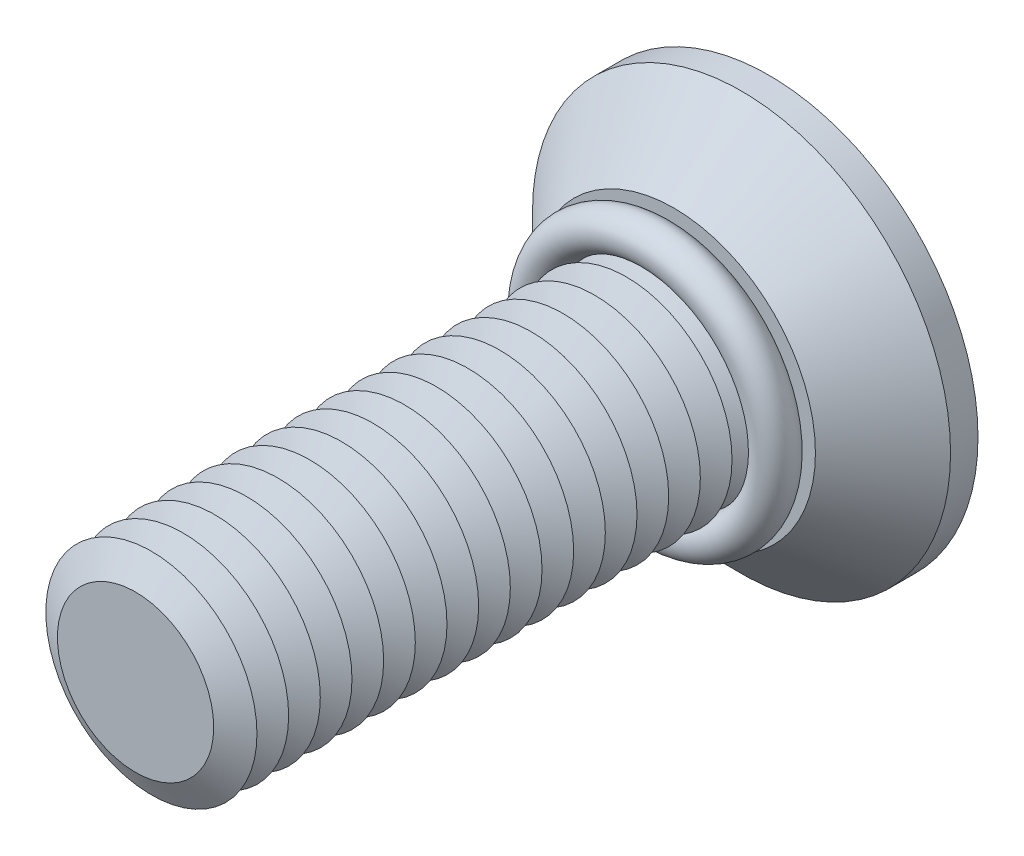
ISO-10303-21;
HEADER;
FILE_DESCRIPTION(('STEP AP214'),'2;1');
FILE_NAME('part.step','',(''),(''),'','','');
FILE_SCHEMA(('AUTOMOTIVE_DESIGN { 1 0 10303 214 1 1 1 1 }'));
ENDSEC;
DATA;
#1=APPLICATION_CONTEXT('core data for automotive mechanical design processes');
#2=APPLICATION_PROTOCOL_DEFINITION('international standard','automotive_design',2000,#1);
#3=PRODUCT_CONTEXT('',#1,'mechanical');
#4=PRODUCT('Part','Part','',(#3));
#5=PRODUCT_RELATED_PRODUCT_CATEGORY('part','',(#4));
#6=PRODUCT_DEFINITION_FORMATION('','',#4);
#7=PRODUCT_DEFINITION_CONTEXT('part definition',#1,'design');
#8=PRODUCT_DEFINITION('design','',#6,#7);
#9=PRODUCT_DEFINITION_SHAPE('','',#8);
#10=(LENGTH_UNIT() NAMED_UNIT(*) SI_UNIT(.MILLI.,.METRE.));
#11=(NAMED_UNIT(*) PLANE_ANGLE_UNIT() SI_UNIT($,.RADIAN.));
#12=(NAMED_UNIT(*) SI_UNIT($,.STERADIAN.) SOLID_ANGLE_UNIT());
#13=UNCERTAINTY_MEASURE_WITH_UNIT(LENGTH_MEASURE(1.E-05),#10,'distance_accuracy_value','');
#14=(GEOMETRIC_REPRESENTATION_CONTEXT(3) GLOBAL_UNCERTAINTY_ASSIGNED_CONTEXT((#13)) GLOBAL_UNIT_ASSIGNED_CONTEXT((#10,
#11,#12)) REPRESENTATION_CONTEXT('',''));
#15=CARTESIAN_POINT('',(0.,0.,0.));
#16=DIRECTION('',(0.,0.,1.));
#17=DIRECTION('',(1.,0.,0.));
#18=AXIS2_PLACEMENT_3D('',#15,#16,#17);
#19=CARTESIAN_POINT('',(0.,0.,5.4));
#20=DIRECTION('',(0.,0.,1.));
#21=DIRECTION('',(1.,0.,0.));
#22=AXIS2_PLACEMENT_3D('',#19,#20,#21);
#23=TOROIDAL_SURFACE('',#22,5.7,0.9);
#24=CARTESIAN_POINT('',(0.,5.7,5.4));
#25=DIRECTION('',(1.,0.,0.));
#26=DIRECTION('',(0.,0.,-1.));
#27=AXIS2_PLACEMENT_3D('',#24,#25,#26);
#28=CIRCLE('',#27,0.9);
#29=CARTESIAN_POINT('',(0.,6.6,5.4));
#30=VERTEX_POINT('',#29);
#31=EDGE_CURVE('P0_E10',#30,#30,#28,.T.);
#32=CARTESIAN_POINT('',(0.,0.,5.4));
#33=DIRECTION('',(0.,0.,1.));
#34=DIRECTION('',(1.,0.,0.));
#35=AXIS2_PLACEMENT_3D('',#32,#33,#34);
#36=CIRCLE('',#35,6.6);
#37=EDGE_CURVE('',#30,#30,#36,.T.);
#38=ORIENTED_EDGE('',*,*,#31,.F.);
#39=ORIENTED_EDGE('',*,*,#31,.T.);
#40=ORIENTED_EDGE('',*,*,#37,.T.);
#41=ORIENTED_EDGE('',*,*,#37,.F.);
#42=EDGE_LOOP('',(#38,#40,#39,#41));
#43=FACE_BOUND('',#42,.T.);
#44=ADVANCED_FACE('P0_F14',(#43),#23,.T.);
#45=CLOSED_SHELL('',(#44));
#46=MANIFOLD_SOLID_BREP('P0_B1',#45);
#47=CARTESIAN_POINT('',(0.,0.,22.5));
#48=DIRECTION('',(0.,0.,-1.));
#49=DIRECTION('',(-1.,0.,0.));
#50=AXIS2_PLACEMENT_3D('',#47,#48,#49);
#51=CONICAL_SURFACE('',#50,3.70096189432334,1.0471975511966);
#52=CARTESIAN_POINT('',(0.,0.,21.75));
#53=DIRECTION('',(0.,0.,1.));
#54=DIRECTION('',(1.,0.,0.));
#55=AXIS2_PLACEMENT_3D('',#52,#53,#54);
#56=CIRCLE('',#55,5.);
#57=CARTESIAN_POINT('',(5.,0.,21.75));
#58=VERTEX_POINT('',#57);
#59=EDGE_CURVE('P1_E324',#58,#58,#56,.T.);
#60=ORIENTED_EDGE('',*,*,#59,.T.);
#61=EDGE_LOOP('',(#60));
#62=FACE_BOUND('',#61,.T.);
#63=CARTESIAN_POINT('',(0.,0.,22.5));
#64=DIRECTION('',(0.,0.,1.));
#65=DIRECTION('',(1.,0.,0.));
#66=AXIS2_PLACEMENT_3D('',#63,#64,#65);
#67=CIRCLE('',#66,3.70096189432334);
#68=CARTESIAN_POINT('',(3.70096189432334,0.,22.5));
#69=VERTEX_POINT('',#68);
#70=EDGE_CURVE('P1_E321',#69,#69,#67,.T.);
#71=ORIENTED_EDGE('',*,*,#70,.F.);
#72=EDGE_LOOP('',(#71));
#73=FACE_BOUND('',#72,.T.);
#74=ADVANCED_FACE('P1_F15',(#62,#73),#51,.T.);
#75=CARTESIAN_POINT('',(0.,0.,23.25));
#76=DIRECTION('',(0.,0.,1.));
#77=DIRECTION('',(1.,0.,0.));
#78=AXIS2_PLACEMENT_3D('',#75,#76,#77);
#79=CONICAL_SURFACE('',#78,5.,1.0471975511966);
#80=ORIENTED_EDGE('',*,*,#70,.T.);
#81=EDGE_LOOP('',(#80));
#82=FACE_BOUND('',#81,.T.);
#83=CARTESIAN_POINT('',(0.,0.,23.25));
#84=DIRECTION('',(0.,0.,1.));
#85=DIRECTION('',(1.,0.,0.));
#86=AXIS2_PLACEMENT_3D('',#83,#84,#85);
#87=CIRCLE('',#86,5.);
#88=CARTESIAN_POINT('',(5.,0.,23.25));
#89=VERTEX_POINT('',#88);
#90=EDGE_CURVE('P1_E318',#89,#89,#87,.T.);
#91=ORIENTED_EDGE('',*,*,#90,.F.);
#92=EDGE_LOOP('',(#91));
#93=FACE_BOUND('',#92,.T.);
#94=ADVANCED_FACE('P1_F245',(#82,#93),#79,.T.);
#95=CARTESIAN_POINT('',(0.,0.,30.));
#96=DIRECTION('',(0.,0.,1.));
#97=DIRECTION('',(1.,0.,0.));
#98=AXIS2_PLACEMENT_3D('',#95,#96,#97);
#99=PLANE('',#98);
#100=CARTESIAN_POINT('',(0.,0.,30.));
#101=DIRECTION('',(0.,0.,1.));
#102=DIRECTION('',(1.,0.,0.));
#103=AXIS2_PLACEMENT_3D('',#100,#101,#102);
#104=CIRCLE('',#103,3.70096189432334);
#105=CARTESIAN_POINT('',(3.70096189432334,0.,30.));
#106=VERTEX_POINT('',#105);
#107=EDGE_CURVE('P1_E131',#106,#106,#104,.T.);
#108=ORIENTED_EDGE('',*,*,#107,.T.);
#109=EDGE_LOOP('',(#108));
#110=FACE_BOUND('',#109,.T.);
#111=ADVANCED_FACE('P1_F251',(#110),#99,.T.);
#112=CARTESIAN_POINT('',(0.,0.,30.));
#113=DIRECTION('',(0.,0.,-1.));
#114=DIRECTION('',(-1.,0.,0.));
#115=AXIS2_PLACEMENT_3D('',#112,#113,#114);
#116=CONICAL_SURFACE('',#115,3.70096189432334,1.0471975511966);
#117=CARTESIAN_POINT('',(0.,0.,29.25));
#118=DIRECTION('',(0.,0.,1.));
#119=DIRECTION('',(1.,0.,0.));
#120=AXIS2_PLACEMENT_3D('',#117,#118,#119);
#121=CIRCLE('',#120,5.);
#122=CARTESIAN_POINT('',(5.,0.,29.25));
#123=VERTEX_POINT('',#122);
#124=EDGE_CURVE('P1_E133',#123,#123,#121,.T.);
#125=ORIENTED_EDGE('',*,*,#124,.T.);
#126=EDGE_LOOP('',(#125));
#127=FACE_BOUND('',#126,.T.);
#128=ORIENTED_EDGE('',*,*,#107,.F.);
#129=EDGE_LOOP('',(#128));
#130=FACE_BOUND('',#129,.T.);
#131=ADVANCED_FACE('P1_F196',(#127,#130),#116,.T.);
#132=CARTESIAN_POINT('',(0.,0.,29.25));
#133=DIRECTION('',(0.,0.,1.));
#134=DIRECTION('',(1.,0.,0.));
#135=AXIS2_PLACEMENT_3D('',#132,#133,#134);
#136=CONICAL_SURFACE('',#135,5.,1.0471975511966);
#137=CARTESIAN_POINT('',(0.,0.,28.5));
#138=DIRECTION('',(0.,0.,1.));
#139=DIRECTION('',(1.,0.,0.));
#140=AXIS2_PLACEMENT_3D('',#137,#138,#139);
#141=CIRCLE('',#140,3.70096189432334);
#142=CARTESIAN_POINT('',(3.70096189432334,0.,28.5));
#143=VERTEX_POINT('',#142);
#144=EDGE_CURVE('P1_E297',#143,#143,#141,.T.);
#145=ORIENTED_EDGE('',*,*,#144,.T.);
#146=EDGE_LOOP('',(#145));
#147=FACE_BOUND('',#146,.T.);
#148=ORIENTED_EDGE('',*,*,#124,.F.);
#149=EDGE_LOOP('',(#148));
#150=FACE_BOUND('',#149,.T.);
#151=ADVANCED_FACE('P1_F284',(#147,#150),#136,.T.);
#152=CARTESIAN_POINT('',(0.,0.,28.5));
#153=DIRECTION('',(0.,0.,-1.));
#154=DIRECTION('',(-1.,0.,0.));
#155=AXIS2_PLACEMENT_3D('',#152,#153,#154);
#156=CONICAL_SURFACE('',#155,3.70096189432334,1.0471975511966);
#157=CARTESIAN_POINT('',(0.,0.,27.75));
#158=DIRECTION('',(0.,0.,1.));
#159=DIRECTION('',(1.,0.,0.));
#160=AXIS2_PLACEMENT_3D('',#157,#158,#159);
#161=CIRCLE('',#160,5.);
#162=CARTESIAN_POINT('',(5.,0.,27.75));
#163=VERTEX_POINT('',#162);
#164=EDGE_CURVE('P1_E294',#163,#163,#161,.T.);
#165=ORIENTED_EDGE('',*,*,#164,.T.);
#166=EDGE_LOOP('',(#165));
#167=FACE_BOUND('',#166,.T.);
#168=ORIENTED_EDGE('',*,*,#144,.F.);
#169=EDGE_LOOP('',(#168));
#170=FACE_BOUND('',#169,.T.);
#171=ADVANCED_FACE('P1_F279',(#167,#170),#156,.T.);
#172=CARTESIAN_POINT('',(0.,0.,27.75));
#173=DIRECTION('',(0.,0.,1.));
#174=DIRECTION('',(1.,0.,0.));
#175=AXIS2_PLACEMENT_3D('',#172,#173,#174);
#176=CONICAL_SURFACE('',#175,5.,1.0471975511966);
#177=CARTESIAN_POINT('',(0.,0.,27.));
#178=DIRECTION('',(0.,0.,1.));
#179=DIRECTION('',(1.,0.,0.));
#180=AXIS2_PLACEMENT_3D('',#177,#178,#179);
#181=CIRCLE('',#180,3.70096189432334);
#182=CARTESIAN_POINT('',(3.70096189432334,0.,27.));
#183=VERTEX_POINT('',#182);
#184=EDGE_CURVE('P1_E301',#183,#183,#181,.T.);
#185=ORIENTED_EDGE('',*,*,#184,.T.);
#186=EDGE_LOOP('',(#185));
#187=FACE_BOUND('',#186,.T.);
#188=ORIENTED_EDGE('',*,*,#164,.F.);
#189=EDGE_LOOP('',(#188));
#190=FACE_BOUND('',#189,.T.);
#191=ADVANCED_FACE('P1_F276',(#187,#190),#176,.T.);
#192=CARTESIAN_POINT('',(0.,0.,27.));
#193=DIRECTION('',(0.,0.,-1.));
#194=DIRECTION('',(-1.,0.,0.));
#195=AXIS2_PLACEMENT_3D('',#192,#193,#194);
#196=CONICAL_SURFACE('',#195,3.70096189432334,1.0471975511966);
#197=CARTESIAN_POINT('',(0.,0.,26.25));
#198=DIRECTION('',(0.,0.,1.));
#199=DIRECTION('',(1.,0.,0.));
#200=AXIS2_PLACEMENT_3D('',#197,#198,#199);
#201=CIRCLE('',#200,5.);
#202=CARTESIAN_POINT('',(5.,0.,26.25));
#203=VERTEX_POINT('',#202);
#204=EDGE_CURVE('P1_E306',#203,#203,#201,.T.);
#205=ORIENTED_EDGE('',*,*,#204,.T.);
#206=EDGE_LOOP('',(#205));
#207=FACE_BOUND('',#206,.T.);
#208=ORIENTED_EDGE('',*,*,#184,.F.);
#209=EDGE_LOOP('',(#208));
#210=FACE_BOUND('',#209,.T.);
#211=ADVANCED_FACE('P1_F271',(#207,#210),#196,.T.);
#212=CARTESIAN_POINT('',(0.,0.,26.25));
#213=DIRECTION('',(0.,0.,1.));
#214=DIRECTION('',(1.,0.,0.));
#215=AXIS2_PLACEMENT_3D('',#212,#213,#214);
#216=CONICAL_SURFACE('',#215,5.,1.0471975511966);
#217=CARTESIAN_POINT('',(0.,0.,25.5));
#218=DIRECTION('',(0.,0.,1.));
#219=DIRECTION('',(1.,0.,0.));
#220=AXIS2_PLACEMENT_3D('',#217,#218,#219);
#221=CIRCLE('',#220,3.70096189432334);
#222=CARTESIAN_POINT('',(3.70096189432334,0.,25.5));
#223=VERTEX_POINT('',#222);
#224=EDGE_CURVE('P1_E309',#223,#223,#221,.T.);
#225=ORIENTED_EDGE('',*,*,#224,.T.);
#226=EDGE_LOOP('',(#225));
#227=FACE_BOUND('',#226,.T.);
#228=ORIENTED_EDGE('',*,*,#204,.F.);
#229=EDGE_LOOP('',(#228));
#230=FACE_BOUND('',#229,.T.);
#231=ADVANCED_FACE('P1_F268',(#227,#230),#216,.T.);
#232=CARTESIAN_POINT('',(0.,0.,25.5));
#233=DIRECTION('',(0.,0.,-1.));
#234=DIRECTION('',(-1.,0.,0.));
#235=AXIS2_PLACEMENT_3D('',#232,#233,#234);
#236=CONICAL_SURFACE('',#235,3.70096189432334,1.0471975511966);
#237=CARTESIAN_POINT('',(0.,0.,24.75));
#238=DIRECTION('',(0.,0.,1.));
#239=DIRECTION('',(1.,0.,0.));
#240=AXIS2_PLACEMENT_3D('',#237,#238,#239);
#241=CIRCLE('',#240,5.);
#242=CARTESIAN_POINT('',(5.,0.,24.75));
#243=VERTEX_POINT('',#242);
#244=EDGE_CURVE('P1_E312',#243,#243,#241,.T.);
#245=ORIENTED_EDGE('',*,*,#244,.T.);
#246=EDGE_LOOP('',(#245));
#247=FACE_BOUND('',#246,.T.);
#248=ORIENTED_EDGE('',*,*,#224,.F.);
#249=EDGE_LOOP('',(#248));
#250=FACE_BOUND('',#249,.T.);
#251=ADVANCED_FACE('P1_F262',(#247,#250),#236,.T.);
#252=CARTESIAN_POINT('',(0.,0.,24.75));
#253=DIRECTION('',(0.,0.,1.));
#254=DIRECTION('',(1.,0.,0.));
#255=AXIS2_PLACEMENT_3D('',#252,#253,#254);
#256=CONICAL_SURFACE('',#255,5.,1.0471975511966);
#257=CARTESIAN_POINT('',(0.,0.,24.));
#258=DIRECTION('',(0.,0.,1.));
#259=DIRECTION('',(1.,0.,0.));
#260=AXIS2_PLACEMENT_3D('',#257,#258,#259);
#261=CIRCLE('',#260,3.70096189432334);
#262=CARTESIAN_POINT('',(3.70096189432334,0.,24.));
#263=VERTEX_POINT('',#262);
#264=EDGE_CURVE('P1_E315',#263,#263,#261,.T.);
#265=ORIENTED_EDGE('',*,*,#264,.T.);
#266=EDGE_LOOP('',(#265));
#267=FACE_BOUND('',#266,.T.);
#268=ORIENTED_EDGE('',*,*,#244,.F.);
#269=EDGE_LOOP('',(#268));
#270=FACE_BOUND('',#269,.T.);
#271=ADVANCED_FACE('P1_F258',(#267,#270),#256,.T.);
#272=CARTESIAN_POINT('',(0.,0.,24.));
#273=DIRECTION('',(0.,0.,-1.));
#274=DIRECTION('',(-1.,0.,0.));
#275=AXIS2_PLACEMENT_3D('',#272,#273,#274);
#276=CONICAL_SURFACE('',#275,3.70096189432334,1.0471975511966);
#277=ORIENTED_EDGE('',*,*,#90,.T.);
#278=EDGE_LOOP('',(#277));
#279=FACE_BOUND('',#278,.T.);
#280=ORIENTED_EDGE('',*,*,#264,.F.);
#281=EDGE_LOOP('',(#280));
#282=FACE_BOUND('',#281,.T.);
#283=ADVANCED_FACE('P1_F261',(#279,#282),#276,.T.);
#284=CARTESIAN_POINT('',(0.,0.,21.));
#285=DIRECTION('',(0.,0.,-1.));
#286=DIRECTION('',(-1.,0.,0.));
#287=AXIS2_PLACEMENT_3D('',#284,#285,#286);
#288=CONICAL_SURFACE('',#287,3.70096189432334,1.0471975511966);
#289=CARTESIAN_POINT('',(0.,0.,20.25));
#290=DIRECTION('',(0.,0.,1.));
#291=DIRECTION('',(1.,0.,0.));
#292=AXIS2_PLACEMENT_3D('',#289,#290,#291);
#293=CIRCLE('',#292,5.);
#294=CARTESIAN_POINT('',(5.,0.,20.25));
#295=VERTEX_POINT('',#294);
#296=EDGE_CURVE('P1_E329',#295,#295,#293,.T.);
#297=ORIENTED_EDGE('',*,*,#296,.T.);
#298=EDGE_LOOP('',(#297));
#299=FACE_BOUND('',#298,.T.);
#300=CARTESIAN_POINT('',(0.,0.,21.));
#301=DIRECTION('',(0.,0.,1.));
#302=DIRECTION('',(1.,0.,0.));
#303=AXIS2_PLACEMENT_3D('',#300,#301,#302);
#304=CIRCLE('',#303,3.70096189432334);
#305=CARTESIAN_POINT('',(3.70096189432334,0.,21.));
#306=VERTEX_POINT('',#305);
#307=EDGE_CURVE('P1_E326',#306,#306,#304,.T.);
#308=ORIENTED_EDGE('',*,*,#307,.F.);
#309=EDGE_LOOP('',(#308));
#310=FACE_BOUND('',#309,.T.);
#311=ADVANCED_FACE('P1_F266',(#299,#310),#288,.T.);
#312=CARTESIAN_POINT('',(0.,0.,21.75));
#313=DIRECTION('',(0.,0.,1.));
#314=DIRECTION('',(1.,0.,0.));
#315=AXIS2_PLACEMENT_3D('',#312,#313,#314);
#316=CONICAL_SURFACE('',#315,5.,1.0471975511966);
#317=ORIENTED_EDGE('',*,*,#307,.T.);
#318=EDGE_LOOP('',(#317));
#319=FACE_BOUND('',#318,.T.);
#320=ORIENTED_EDGE('',*,*,#59,.F.);
#321=EDGE_LOOP('',(#320));
#322=FACE_BOUND('',#321,.T.);
#323=ADVANCED_FACE('P1_F491',(#319,#322),#316,.T.);
#324=CARTESIAN_POINT('',(0.,0.,19.5));
#325=DIRECTION('',(0.,0.,-1.));
#326=DIRECTION('',(-1.,0.,0.));
#327=AXIS2_PLACEMENT_3D('',#324,#325,#326);
#328=CONICAL_SURFACE('',#327,3.70096189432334,1.0471975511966);
#329=CARTESIAN_POINT('',(0.,0.,18.75));
#330=DIRECTION('',(0.,0.,1.));
#331=DIRECTION('',(1.,0.,0.));
#332=AXIS2_PLACEMENT_3D('',#329,#330,#331);
#333=CIRCLE('',#332,5.);
#334=CARTESIAN_POINT('',(5.,0.,18.75));
#335=VERTEX_POINT('',#334);
#336=EDGE_CURVE('P1_E335',#335,#335,#333,.T.);
#337=ORIENTED_EDGE('',*,*,#336,.T.);
#338=EDGE_LOOP('',(#337));
#339=FACE_BOUND('',#338,.T.);
#340=CARTESIAN_POINT('',(0.,0.,19.5));
#341=DIRECTION('',(0.,0.,1.));
#342=DIRECTION('',(1.,0.,0.));
#343=AXIS2_PLACEMENT_3D('',#340,#341,#342);
#344=CIRCLE('',#343,3.70096189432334);
#345=CARTESIAN_POINT('',(3.70096189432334,0.,19.5));
#346=VERTEX_POINT('',#345);
#347=EDGE_CURVE('P1_E332',#346,#346,#344,.T.);
#348=ORIENTED_EDGE('',*,*,#347,.F.);
#349=EDGE_LOOP('',(#348));
#350=FACE_BOUND('',#349,.T.);
#351=ADVANCED_FACE('P1_F500',(#339,#350),#328,.T.);
#352=CARTESIAN_POINT('',(0.,0.,20.25));
#353=DIRECTION('',(0.,0.,1.));
#354=DIRECTION('',(1.,0.,0.));
#355=AXIS2_PLACEMENT_3D('',#352,#353,#354);
#356=CONICAL_SURFACE('',#355,5.,1.0471975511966);
#357=ORIENTED_EDGE('',*,*,#347,.T.);
#358=EDGE_LOOP('',(#357));
#359=FACE_BOUND('',#358,.T.);
#360=ORIENTED_EDGE('',*,*,#296,.F.);
#361=EDGE_LOOP('',(#360));
#362=FACE_BOUND('',#361,.T.);
#363=ADVANCED_FACE('P1_F510',(#359,#362),#356,.T.);
#364=CARTESIAN_POINT('',(0.,0.,18.));
#365=DIRECTION('',(0.,0.,-1.));
#366=DIRECTION('',(-1.,0.,0.));
#367=AXIS2_PLACEMENT_3D('',#364,#365,#366);
#368=CONICAL_SURFACE('',#367,3.70096189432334,1.0471975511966);
#369=CARTESIAN_POINT('',(0.,0.,17.25));
#370=DIRECTION('',(0.,0.,1.));
#371=DIRECTION('',(1.,0.,0.));
#372=AXIS2_PLACEMENT_3D('',#369,#370,#371);
#373=CIRCLE('',#372,5.);
#374=CARTESIAN_POINT('',(5.,0.,17.25));
#375=VERTEX_POINT('',#374);
#376=EDGE_CURVE('P1_E341',#375,#375,#373,.T.);
#377=ORIENTED_EDGE('',*,*,#376,.T.);
#378=EDGE_LOOP('',(#377));
#379=FACE_BOUND('',#378,.T.);
#380=CARTESIAN_POINT('',(0.,0.,18.));
#381=DIRECTION('',(0.,0.,1.));
#382=DIRECTION('',(1.,0.,0.));
#383=AXIS2_PLACEMENT_3D('',#380,#381,#382);
#384=CIRCLE('',#383,3.70096189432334);
#385=CARTESIAN_POINT('',(3.70096189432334,0.,18.));
#386=VERTEX_POINT('',#385);
#387=EDGE_CURVE('P1_E338',#386,#386,#384,.T.);
#388=ORIENTED_EDGE('',*,*,#387,.F.);
#389=EDGE_LOOP('',(#388));
#390=FACE_BOUND('',#389,.T.);
#391=ADVANCED_FACE('P1_F520',(#379,#390),#368,.T.);
#392=CARTESIAN_POINT('',(0.,0.,18.75));
#393=DIRECTION('',(0.,0.,1.));
#394=DIRECTION('',(1.,0.,0.));
#395=AXIS2_PLACEMENT_3D('',#392,#393,#394);
#396=CONICAL_SURFACE('',#395,5.,1.0471975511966);
#397=ORIENTED_EDGE('',*,*,#387,.T.);
#398=EDGE_LOOP('',(#397));
#399=FACE_BOUND('',#398,.T.);
#400=ORIENTED_EDGE('',*,*,#336,.F.);
#401=EDGE_LOOP('',(#400));
#402=FACE_BOUND('',#401,.T.);
#403=ADVANCED_FACE('P1_F530',(#399,#402),#396,.T.);
#404=CARTESIAN_POINT('',(0.,0.,16.5));
#405=DIRECTION('',(0.,0.,-1.));
#406=DIRECTION('',(-1.,0.,0.));
#407=AXIS2_PLACEMENT_3D('',#404,#405,#406);
#408=CONICAL_SURFACE('',#407,3.70096189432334,1.0471975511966);
#409=CARTESIAN_POINT('',(0.,0.,15.75));
#410=DIRECTION('',(0.,0.,1.));
#411=DIRECTION('',(1.,0.,0.));
#412=AXIS2_PLACEMENT_3D('',#409,#410,#411);
#413=CIRCLE('',#412,5.);
#414=CARTESIAN_POINT('',(5.,0.,15.75));
#415=VERTEX_POINT('',#414);
#416=EDGE_CURVE('P1_E347',#415,#415,#413,.T.);
#417=ORIENTED_EDGE('',*,*,#416,.T.);
#418=EDGE_LOOP('',(#417));
#419=FACE_BOUND('',#418,.T.);
#420=CARTESIAN_POINT('',(0.,0.,16.5));
#421=DIRECTION('',(0.,0.,1.));
#422=DIRECTION('',(1.,0.,0.));
#423=AXIS2_PLACEMENT_3D('',#420,#421,#422);
#424=CIRCLE('',#423,3.70096189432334);
#425=CARTESIAN_POINT('',(3.70096189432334,0.,16.5));
#426=VERTEX_POINT('',#425);
#427=EDGE_CURVE('P1_E344',#426,#426,#424,.T.);
#428=ORIENTED_EDGE('',*,*,#427,.F.);
#429=EDGE_LOOP('',(#428));
#430=FACE_BOUND('',#429,.T.);
#431=ADVANCED_FACE('P1_F540',(#419,#430),#408,.T.);
#432=CARTESIAN_POINT('',(0.,0.,17.25));
#433=DIRECTION('',(0.,0.,1.));
#434=DIRECTION('',(1.,0.,0.));
#435=AXIS2_PLACEMENT_3D('',#432,#433,#434);
#436=CONICAL_SURFACE('',#435,5.,1.0471975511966);
#437=ORIENTED_EDGE('',*,*,#427,.T.);
#438=EDGE_LOOP('',(#437));
#439=FACE_BOUND('',#438,.T.);
#440=ORIENTED_EDGE('',*,*,#376,.F.);
#441=EDGE_LOOP('',(#440));
#442=FACE_BOUND('',#441,.T.);
#443=ADVANCED_FACE('P1_F550',(#439,#442),#436,.T.);
#444=CARTESIAN_POINT('',(0.,0.,15.));
#445=DIRECTION('',(0.,0.,-1.));
#446=DIRECTION('',(-1.,0.,0.));
#447=AXIS2_PLACEMENT_3D('',#444,#445,#446);
#448=CONICAL_SURFACE('',#447,3.70096189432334,1.0471975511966);
#449=CARTESIAN_POINT('',(0.,0.,14.25));
#450=DIRECTION('',(0.,0.,1.));
#451=DIRECTION('',(1.,0.,0.));
#452=AXIS2_PLACEMENT_3D('',#449,#450,#451);
#453=CIRCLE('',#452,5.);
#454=CARTESIAN_POINT('',(5.,0.,14.25));
#455=VERTEX_POINT('',#454);
#456=EDGE_CURVE('P1_E353',#455,#455,#453,.T.);
#457=ORIENTED_EDGE('',*,*,#456,.T.);
#458=EDGE_LOOP('',(#457));
#459=FACE_BOUND('',#458,.T.);
#460=CARTESIAN_POINT('',(0.,0.,15.));
#461=DIRECTION('',(0.,0.,1.));
#462=DIRECTION('',(1.,0.,0.));
#463=AXIS2_PLACEMENT_3D('',#460,#461,#462);
#464=CIRCLE('',#463,3.70096189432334);
#465=CARTESIAN_POINT('',(3.70096189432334,0.,15.));
#466=VERTEX_POINT('',#465);
#467=EDGE_CURVE('P1_E350',#466,#466,#464,.T.);
#468=ORIENTED_EDGE('',*,*,#467,.F.);
#469=EDGE_LOOP('',(#468));
#470=FACE_BOUND('',#469,.T.);
#471=ADVANCED_FACE('P1_F560',(#459,#470),#448,.T.);
#472=CARTESIAN_POINT('',(0.,0.,15.75));
#473=DIRECTION('',(0.,0.,1.));
#474=DIRECTION('',(1.,0.,0.));
#475=AXIS2_PLACEMENT_3D('',#472,#473,#474);
#476=CONICAL_SURFACE('',#475,5.,1.0471975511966);
#477=ORIENTED_EDGE('',*,*,#467,.T.);
#478=EDGE_LOOP('',(#477));
#479=FACE_BOUND('',#478,.T.);
#480=ORIENTED_EDGE('',*,*,#416,.F.);
#481=EDGE_LOOP('',(#480));
#482=FACE_BOUND('',#481,.T.);
#483=ADVANCED_FACE('P1_F570',(#479,#482),#476,.T.);
#484=CARTESIAN_POINT('',(0.,0.,13.5));
#485=DIRECTION('',(0.,0.,-1.));
#486=DIRECTION('',(-1.,0.,0.));
#487=AXIS2_PLACEMENT_3D('',#484,#485,#486);
#488=CONICAL_SURFACE('',#487,3.70096189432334,1.0471975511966);
#489=CARTESIAN_POINT('',(0.,0.,12.75));
#490=DIRECTION('',(0.,0.,1.));
#491=DIRECTION('',(1.,0.,0.));
#492=AXIS2_PLACEMENT_3D('',#489,#490,#491);
#493=CIRCLE('',#492,5.);
#494=CARTESIAN_POINT('',(5.,0.,12.75));
#495=VERTEX_POINT('',#494);
#496=EDGE_CURVE('P1_E359',#495,#495,#493,.T.);
#497=ORIENTED_EDGE('',*,*,#496,.T.);
#498=EDGE_LOOP('',(#497));
#499=FACE_BOUND('',#498,.T.);
#500=CARTESIAN_POINT('',(0.,0.,13.5));
#501=DIRECTION('',(0.,0.,1.));
#502=DIRECTION('',(1.,0.,0.));
#503=AXIS2_PLACEMENT_3D('',#500,#501,#502);
#504=CIRCLE('',#503,3.70096189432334);
#505=CARTESIAN_POINT('',(3.70096189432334,0.,13.5));
#506=VERTEX_POINT('',#505);
#507=EDGE_CURVE('P1_E356',#506,#506,#504,.T.);
#508=ORIENTED_EDGE('',*,*,#507,.F.);
#509=EDGE_LOOP('',(#508));
#510=FACE_BOUND('',#509,.T.);
#511=ADVANCED_FACE('P1_F580',(#499,#510),#488,.T.);
#512=CARTESIAN_POINT('',(0.,0.,14.25));
#513=DIRECTION('',(0.,0.,1.));
#514=DIRECTION('',(1.,0.,0.));
#515=AXIS2_PLACEMENT_3D('',#512,#513,#514);
#516=CONICAL_SURFACE('',#515,5.,1.0471975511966);
#517=ORIENTED_EDGE('',*,*,#507,.T.);
#518=EDGE_LOOP('',(#517));
#519=FACE_BOUND('',#518,.T.);
#520=ORIENTED_EDGE('',*,*,#456,.F.);
#521=EDGE_LOOP('',(#520));
#522=FACE_BOUND('',#521,.T.);
#523=ADVANCED_FACE('P1_F590',(#519,#522),#516,.T.);
#524=CARTESIAN_POINT('',(0.,0.,12.));
#525=DIRECTION('',(0.,0.,-1.));
#526=DIRECTION('',(-1.,0.,0.));
#527=AXIS2_PLACEMENT_3D('',#524,#525,#526);
#528=CONICAL_SURFACE('',#527,3.70096189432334,1.0471975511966);
#529=CARTESIAN_POINT('',(0.,0.,11.25));
#530=DIRECTION('',(0.,0.,1.));
#531=DIRECTION('',(1.,0.,0.));
#532=AXIS2_PLACEMENT_3D('',#529,#530,#531);
#533=CIRCLE('',#532,5.);
#534=CARTESIAN_POINT('',(5.,0.,11.25));
#535=VERTEX_POINT('',#534);
#536=EDGE_CURVE('P1_E365',#535,#535,#533,.T.);
#537=ORIENTED_EDGE('',*,*,#536,.T.);
#538=EDGE_LOOP('',(#537));
#539=FACE_BOUND('',#538,.T.);
#540=CARTESIAN_POINT('',(0.,0.,12.));
#541=DIRECTION('',(0.,0.,1.));
#542=DIRECTION('',(1.,0.,0.));
#543=AXIS2_PLACEMENT_3D('',#540,#541,#542);
#544=CIRCLE('',#543,3.70096189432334);
#545=CARTESIAN_POINT('',(3.70096189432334,0.,12.));
#546=VERTEX_POINT('',#545);
#547=EDGE_CURVE('P1_E362',#546,#546,#544,.T.);
#548=ORIENTED_EDGE('',*,*,#547,.F.);
#549=EDGE_LOOP('',(#548));
#550=FACE_BOUND('',#549,.T.);
#551=ADVANCED_FACE('P1_F600',(#539,#550),#528,.T.);
#552=CARTESIAN_POINT('',(0.,0.,12.75));
#553=DIRECTION('',(0.,0.,1.));
#554=DIRECTION('',(1.,0.,0.));
#555=AXIS2_PLACEMENT_3D('',#552,#553,#554);
#556=CONICAL_SURFACE('',#555,5.,1.0471975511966);
#557=ORIENTED_EDGE('',*,*,#547,.T.);
#558=EDGE_LOOP('',(#557));
#559=FACE_BOUND('',#558,.T.);
#560=ORIENTED_EDGE('',*,*,#496,.F.);
#561=EDGE_LOOP('',(#560));
#562=FACE_BOUND('',#561,.T.);
#563=ADVANCED_FACE('P1_F610',(#559,#562),#556,.T.);
#564=CARTESIAN_POINT('',(0.,0.,10.5));
#565=DIRECTION('',(0.,0.,-1.));
#566=DIRECTION('',(-1.,0.,0.));
#567=AXIS2_PLACEMENT_3D('',#564,#565,#566);
#568=CONICAL_SURFACE('',#567,3.70096189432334,1.0471975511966);
#569=CARTESIAN_POINT('',(0.,0.,9.75));
#570=DIRECTION('',(0.,0.,1.));
#571=DIRECTION('',(1.,0.,0.));
#572=AXIS2_PLACEMENT_3D('',#569,#570,#571);
#573=CIRCLE('',#572,5.);
#574=CARTESIAN_POINT('',(5.,0.,9.75));
#575=VERTEX_POINT('',#574);
#576=EDGE_CURVE('P1_E371',#575,#575,#573,.T.);
#577=ORIENTED_EDGE('',*,*,#576,.T.);
#578=EDGE_LOOP('',(#577));
#579=FACE_BOUND('',#578,.T.);
#580=CARTESIAN_POINT('',(0.,0.,10.5));
#581=DIRECTION('',(0.,0.,1.));
#582=DIRECTION('',(1.,0.,0.));
#583=AXIS2_PLACEMENT_3D('',#580,#581,#582);
#584=CIRCLE('',#583,3.70096189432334);
#585=CARTESIAN_POINT('',(3.70096189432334,0.,10.5));
#586=VERTEX_POINT('',#585);
#587=EDGE_CURVE('P1_E368',#586,#586,#584,.T.);
#588=ORIENTED_EDGE('',*,*,#587,.F.);
#589=EDGE_LOOP('',(#588));
#590=FACE_BOUND('',#589,.T.);
#591=ADVANCED_FACE('P1_F620',(#579,#590),#568,.T.);
#592=CARTESIAN_POINT('',(0.,0.,11.25));
#593=DIRECTION('',(0.,0.,1.));
#594=DIRECTION('',(1.,0.,0.));
#595=AXIS2_PLACEMENT_3D('',#592,#593,#594);
#596=CONICAL_SURFACE('',#595,5.,1.0471975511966);
#597=ORIENTED_EDGE('',*,*,#587,.T.);
#598=EDGE_LOOP('',(#597));
#599=FACE_BOUND('',#598,.T.);
#600=ORIENTED_EDGE('',*,*,#536,.F.);
#601=EDGE_LOOP('',(#600));
#602=FACE_BOUND('',#601,.T.);
#603=ADVANCED_FACE('P1_F630',(#599,#602),#596,.T.);
#604=CARTESIAN_POINT('',(0.,0.,9.));
#605=DIRECTION('',(0.,0.,-1.));
#606=DIRECTION('',(-1.,0.,0.));
#607=AXIS2_PLACEMENT_3D('',#604,#605,#606);
#608=CONICAL_SURFACE('',#607,3.70096189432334,1.0471975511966);
#609=CARTESIAN_POINT('',(0.,0.,8.25));
#610=DIRECTION('',(0.,0.,1.));
#611=DIRECTION('',(1.,0.,0.));
#612=AXIS2_PLACEMENT_3D('',#609,#610,#611);
#613=CIRCLE('',#612,5.);
#614=CARTESIAN_POINT('',(5.,0.,8.25));
#615=VERTEX_POINT('',#614);
#616=EDGE_CURVE('P1_E377',#615,#615,#613,.T.);
#617=ORIENTED_EDGE('',*,*,#616,.T.);
#618=EDGE_LOOP('',(#617));
#619=FACE_BOUND('',#618,.T.);
#620=CARTESIAN_POINT('',(0.,0.,9.));
#621=DIRECTION('',(0.,0.,1.));
#622=DIRECTION('',(1.,0.,0.));
#623=AXIS2_PLACEMENT_3D('',#620,#621,#622);
#624=CIRCLE('',#623,3.70096189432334);
#625=CARTESIAN_POINT('',(3.70096189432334,0.,9.));
#626=VERTEX_POINT('',#625);
#627=EDGE_CURVE('P1_E374',#626,#626,#624,.T.);
#628=ORIENTED_EDGE('',*,*,#627,.F.);
#629=EDGE_LOOP('',(#628));
#630=FACE_BOUND('',#629,.T.);
#631=ADVANCED_FACE('P1_F640',(#619,#630),#608,.T.);
#632=CARTESIAN_POINT('',(0.,0.,9.75));
#633=DIRECTION('',(0.,0.,1.));
#634=DIRECTION('',(1.,0.,0.));
#635=AXIS2_PLACEMENT_3D('',#632,#633,#634);
#636=CONICAL_SURFACE('',#635,5.,1.0471975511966);
#637=ORIENTED_EDGE('',*,*,#627,.T.);
#638=EDGE_LOOP('',(#637));
#639=FACE_BOUND('',#638,.T.);
#640=ORIENTED_EDGE('',*,*,#576,.F.);
#641=EDGE_LOOP('',(#640));
#642=FACE_BOUND('',#641,.T.);
#643=ADVANCED_FACE('P1_F650',(#639,#642),#636,.T.);
#644=CARTESIAN_POINT('',(0.,0.,7.5));
#645=DIRECTION('',(0.,0.,-1.));
#646=DIRECTION('',(-1.,0.,0.));
#647=AXIS2_PLACEMENT_3D('',#644,#645,#646);
#648=CONICAL_SURFACE('',#647,3.70096189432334,1.0471975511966);
#649=CARTESIAN_POINT('',(0.,0.,6.75));
#650=DIRECTION('',(0.,0.,1.));
#651=DIRECTION('',(1.,0.,0.));
#652=AXIS2_PLACEMENT_3D('',#649,#650,#651);
#653=CIRCLE('',#652,5.);
#654=CARTESIAN_POINT('',(5.,0.,6.75));
#655=VERTEX_POINT('',#654);
#656=EDGE_CURVE('P1_E383',#655,#655,#653,.T.);
#657=ORIENTED_EDGE('',*,*,#656,.T.);
#658=EDGE_LOOP('',(#657));
#659=FACE_BOUND('',#658,.T.);
#660=CARTESIAN_POINT('',(0.,0.,7.5));
#661=DIRECTION('',(0.,0.,1.));
#662=DIRECTION('',(1.,0.,0.));
#663=AXIS2_PLACEMENT_3D('',#660,#661,#662);
#664=CIRCLE('',#663,3.70096189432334);
#665=CARTESIAN_POINT('',(3.70096189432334,0.,7.5));
#666=VERTEX_POINT('',#665);
#667=EDGE_CURVE('P1_E380',#666,#666,#664,.T.);
#668=ORIENTED_EDGE('',*,*,#667,.F.);
#669=EDGE_LOOP('',(#668));
#670=FACE_BOUND('',#669,.T.);
#671=ADVANCED_FACE('P1_F660',(#659,#670),#648,.T.);
#672=CARTESIAN_POINT('',(0.,0.,8.25));
#673=DIRECTION('',(0.,0.,1.));
#674=DIRECTION('',(1.,0.,0.));
#675=AXIS2_PLACEMENT_3D('',#672,#673,#674);
#676=CONICAL_SURFACE('',#675,5.,1.0471975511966);
#677=ORIENTED_EDGE('',*,*,#667,.T.);
#678=EDGE_LOOP('',(#677));
#679=FACE_BOUND('',#678,.T.);
#680=ORIENTED_EDGE('',*,*,#616,.F.);
#681=EDGE_LOOP('',(#680));
#682=FACE_BOUND('',#681,.T.);
#683=ADVANCED_FACE('P1_F396',(#679,#682),#676,.T.);
#684=CARTESIAN_POINT('',(0.,0.,6.));
#685=DIRECTION('',(0.,0.,-1.));
#686=DIRECTION('',(-1.,0.,0.));
#687=AXIS2_PLACEMENT_3D('',#684,#685,#686);
#688=CONICAL_SURFACE('',#687,3.70096189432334,1.0471975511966);
#689=CARTESIAN_POINT('',(0.,0.,6.));
#690=DIRECTION('',(0.,0.,1.));
#691=DIRECTION('',(1.,0.,0.));
#692=AXIS2_PLACEMENT_3D('',#689,#690,#691);
#693=CIRCLE('',#692,3.70096189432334);
#694=CARTESIAN_POINT('',(3.70096189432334,0.,6.));
#695=VERTEX_POINT('',#694);
#696=EDGE_CURVE('P1_E386',#695,#695,#693,.T.);
#697=ORIENTED_EDGE('',*,*,#696,.F.);
#698=EDGE_LOOP('',(#697));
#699=FACE_BOUND('',#698,.T.);
#700=CARTESIAN_POINT('',(0.,0.,5.36547005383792));
#701=DIRECTION('',(0.,0.,-1.));
#702=DIRECTION('',(-1.,0.,0.));
#703=AXIS2_PLACEMENT_3D('',#700,#701,#702);
#704=CIRCLE('',#703,4.8);
#705=CARTESIAN_POINT('',(-4.8,0.,5.36547005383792));
#706=VERTEX_POINT('',#705);
#707=EDGE_CURVE('P1_E19',#706,#706,#704,.F.);
#708=ORIENTED_EDGE('',*,*,#707,.T.);
#709=EDGE_LOOP('',(#708));
#710=FACE_BOUND('',#709,.T.);
#711=ADVANCED_FACE('P1_F393',(#699,#710),#688,.T.);
#712=CARTESIAN_POINT('',(0.,0.,6.75));
#713=DIRECTION('',(0.,0.,1.));
#714=DIRECTION('',(1.,0.,0.));
#715=AXIS2_PLACEMENT_3D('',#712,#713,#714);
#716=CONICAL_SURFACE('',#715,5.,1.0471975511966);
#717=ORIENTED_EDGE('',*,*,#696,.T.);
#718=EDGE_LOOP('',(#717));
#719=FACE_BOUND('',#718,.T.);
#720=ORIENTED_EDGE('',*,*,#656,.F.);
#721=EDGE_LOOP('',(#720));
#722=FACE_BOUND('',#721,.T.);
#723=ADVANCED_FACE('P1_F390',(#719,#722),#716,.T.);
#724=CARTESIAN_POINT('',(0.,0.,4.));
#725=DIRECTION('',(0.,0.,-1.));
#726=DIRECTION('',(-1.,0.,0.));
#727=AXIS2_PLACEMENT_3D('',#724,#725,#726);
#728=CONICAL_SURFACE('',#727,3.,1.0471975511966);
#729=CARTESIAN_POINT('',(0.,0.,5.73205080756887));
#730=VERTEX_POINT('',#729);
#731=VERTEX_LOOP('',#730);
#732=FACE_BOUND('',#731,.T.);
#733=CARTESIAN_POINT('',(0.,0.,4.));
#734=DIRECTION('',(0.,0.,-1.));
#735=DIRECTION('',(-1.,0.,0.));
#736=AXIS2_PLACEMENT_3D('',#733,#734,#735);
#737=CIRCLE('',#736,3.);
#738=CARTESIAN_POINT('',(-3.,0.,4.));
#739=VERTEX_POINT('',#738);
#740=CARTESIAN_POINT('',(-1.5,2.59807621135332,4.));
#741=VERTEX_POINT('',#740);
#742=EDGE_CURVE('P1_E117',#739,#741,#737,.T.);
#743=ORIENTED_EDGE('',*,*,#742,.T.);
#744=CARTESIAN_POINT('',(0.,0.,4.));
#745=DIRECTION('',(0.,0.,-1.));
#746=DIRECTION('',(-1.,0.,0.));
#747=AXIS2_PLACEMENT_3D('',#744,#745,#746);
#748=CIRCLE('',#747,3.);
#749=CARTESIAN_POINT('',(1.5,2.59807621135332,4.));
#750=VERTEX_POINT('',#749);
#751=EDGE_CURVE('P1_E24',#741,#750,#748,.T.);
#752=ORIENTED_EDGE('',*,*,#751,.T.);
#753=CARTESIAN_POINT('',(3.,0.,4.));
#754=VERTEX_POINT('',#753);
#755=EDGE_CURVE('P1_E895',#750,#754,#748,.T.);
#756=ORIENTED_EDGE('',*,*,#755,.T.);
#757=CARTESIAN_POINT('',(1.5,-2.59807621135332,4.));
#758=VERTEX_POINT('',#757);
#759=EDGE_CURVE('P1_E888',#754,#758,#748,.T.);
#760=ORIENTED_EDGE('',*,*,#759,.T.);
#761=CARTESIAN_POINT('',(-1.5,-2.59807621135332,4.));
#762=VERTEX_POINT('',#761);
#763=EDGE_CURVE('P1_E182',#758,#762,#748,.T.);
#764=ORIENTED_EDGE('',*,*,#763,.T.);
#765=EDGE_CURVE('P1_E179',#762,#739,#748,.T.);
#766=ORIENTED_EDGE('',*,*,#765,.T.);
#767=EDGE_LOOP('',(#743,#752,#756,#760,#764,#766));
#768=FACE_BOUND('',#767,.T.);
#769=ADVANCED_FACE('P1_F198',(#732,#768),#728,.F.);
#770=CARTESIAN_POINT('',(0.,0.,4.));
#771=DIRECTION('',(0.,0.,-1.));
#772=DIRECTION('',(-1.,0.,0.));
#773=AXIS2_PLACEMENT_3D('',#770,#771,#772);
#774=PLANE('',#773);
#775=ORIENTED_EDGE('',*,*,#763,.F.);
#776=DIRECTION('',(-0.866025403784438,-0.5,0.));
#777=VECTOR('',#776,1.);
#778=CARTESIAN_POINT('',(3.,-1.73205080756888,4.));
#779=LINE('',#778,#777);
#780=CARTESIAN_POINT('',(0.,-3.46410161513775,4.));
#781=VERTEX_POINT('',#780);
#782=EDGE_CURVE('P1_E904',#758,#781,#779,.T.);
#783=ORIENTED_EDGE('',*,*,#782,.T.);
#784=DIRECTION('',(-0.866025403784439,0.5,0.));
#785=VECTOR('',#784,1.);
#786=CARTESIAN_POINT('',(0.,-3.46410161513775,4.));
#787=LINE('',#786,#785);
#788=EDGE_CURVE('P1_E911',#781,#762,#787,.T.);
#789=ORIENTED_EDGE('',*,*,#788,.T.);
#790=EDGE_LOOP('',(#775,#783,#789));
#791=FACE_BOUND('',#790,.T.);
#792=ADVANCED_FACE('P1_F702',(#791),#774,.T.);
#793=ORIENTED_EDGE('',*,*,#765,.F.);
#794=CARTESIAN_POINT('',(-3.,-1.73205080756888,4.));
#795=VERTEX_POINT('',#794);
#796=EDGE_CURVE('P1_E914',#762,#795,#787,.T.);
#797=ORIENTED_EDGE('',*,*,#796,.T.);
#798=DIRECTION('',(0.,1.,0.));
#799=VECTOR('',#798,1.);
#800=CARTESIAN_POINT('',(-3.,-1.73205080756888,4.));
#801=LINE('',#800,#799);
#802=EDGE_CURVE('P1_E123',#795,#739,#801,.T.);
#803=ORIENTED_EDGE('',*,*,#802,.T.);
#804=EDGE_LOOP('',(#793,#797,#803));
#805=FACE_BOUND('',#804,.T.);
#806=ADVANCED_FACE('P1_F231',(#805),#774,.T.);
#807=ORIENTED_EDGE('',*,*,#742,.F.);
#808=CARTESIAN_POINT('',(-3.,1.73205080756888,4.));
#809=VERTEX_POINT('',#808);
#810=EDGE_CURVE('P1_E916',#739,#809,#801,.T.);
#811=ORIENTED_EDGE('',*,*,#810,.T.);
#812=DIRECTION('',(0.866025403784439,0.5,0.));
#813=VECTOR('',#812,1.);
#814=CARTESIAN_POINT('',(-3.,1.73205080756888,4.));
#815=LINE('',#814,#813);
#816=EDGE_CURVE('P1_E919',#809,#741,#815,.T.);
#817=ORIENTED_EDGE('',*,*,#816,.T.);
#818=EDGE_LOOP('',(#807,#811,#817));
#819=FACE_BOUND('',#818,.T.);
#820=ADVANCED_FACE('P1_F719',(#819),#774,.T.);
#821=ORIENTED_EDGE('',*,*,#751,.F.);
#822=CARTESIAN_POINT('',(0.,3.46410161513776,4.));
#823=VERTEX_POINT('',#822);
#824=EDGE_CURVE('P1_E918',#741,#823,#815,.T.);
#825=ORIENTED_EDGE('',*,*,#824,.T.);
#826=DIRECTION('',(0.866025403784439,-0.5,0.));
#827=VECTOR('',#826,1.);
#828=CARTESIAN_POINT('',(0.,3.46410161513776,4.));
#829=LINE('',#828,#827);
#830=EDGE_CURVE('P1_E161',#823,#750,#829,.T.);
#831=ORIENTED_EDGE('',*,*,#830,.T.);
#832=EDGE_LOOP('',(#821,#825,#831));
#833=FACE_BOUND('',#832,.T.);
#834=ADVANCED_FACE('P1_F728',(#833),#774,.T.);
#835=ORIENTED_EDGE('',*,*,#755,.F.);
#836=CARTESIAN_POINT('',(3.,1.73205080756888,4.));
#837=VERTEX_POINT('',#836);
#838=EDGE_CURVE('P1_E903',#750,#837,#829,.T.);
#839=ORIENTED_EDGE('',*,*,#838,.T.);
#840=DIRECTION('',(0.,-1.,0.));
#841=VECTOR('',#840,1.);
#842=CARTESIAN_POINT('',(3.,1.73205080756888,4.));
#843=LINE('',#842,#841);
#844=EDGE_CURVE('P1_E898',#837,#754,#843,.T.);
#845=ORIENTED_EDGE('',*,*,#844,.T.);
#846=EDGE_LOOP('',(#835,#839,#845));
#847=FACE_BOUND('',#846,.T.);
#848=ADVANCED_FACE('P1_F737',(#847),#774,.T.);
#849=ORIENTED_EDGE('',*,*,#759,.F.);
#850=CARTESIAN_POINT('',(3.,-1.73205080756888,4.));
#851=VERTEX_POINT('',#850);
#852=EDGE_CURVE('P1_E890',#754,#851,#843,.T.);
#853=ORIENTED_EDGE('',*,*,#852,.T.);
#854=EDGE_CURVE('P1_E125',#851,#758,#779,.T.);
#855=ORIENTED_EDGE('',*,*,#854,.T.);
#856=EDGE_LOOP('',(#849,#853,#855));
#857=FACE_BOUND('',#856,.T.);
#858=ADVANCED_FACE('P1_F229',(#857),#774,.T.);
#859=CARTESIAN_POINT('',(3.,-1.73205080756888,4.));
#860=DIRECTION('',(0.5,-0.866025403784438,0.));
#861=DIRECTION('',(0.866025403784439,0.5,0.));
#862=AXIS2_PLACEMENT_3D('',#859,#860,#861);
#863=PLANE('',#862);
#864=DIRECTION('',(0.,0.,-1.));
#865=VECTOR('',#864,1.);
#866=CARTESIAN_POINT('',(3.,-1.73205080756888,4.));
#867=LINE('',#866,#865);
#868=CARTESIAN_POINT('',(3.,-1.73205080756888,0.));
#869=VERTEX_POINT('',#868);
#870=EDGE_CURVE('P1_E164',#851,#869,#867,.T.);
#871=ORIENTED_EDGE('',*,*,#870,.T.);
#872=CARTESIAN_POINT('',(3.0002,-1.73193533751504,-3.09416546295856E-05));
#873=CARTESIAN_POINT('',(2.8756009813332,-1.80387261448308,0.0192538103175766));
#874=CARTESIAN_POINT('',(2.75077603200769,-1.87594033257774,0.036761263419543));
#875=CARTESIAN_POINT('',(2.50068525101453,-2.02033031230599,0.067520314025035));
#876=CARTESIAN_POINT('',(2.37541926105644,-2.0926526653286,0.0807701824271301));
#877=CARTESIAN_POINT('',(2.12520598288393,-2.23711336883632,0.102240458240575));
#878=CARTESIAN_POINT('',(2.00026038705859,-2.30925074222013,0.110486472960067));
#879=CARTESIAN_POINT('',(1.75020983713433,-2.45361749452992,0.121543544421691));
#880=CARTESIAN_POINT('',(1.62510491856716,-2.52584685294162,0.12435565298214));
#881=CARTESIAN_POINT('',(1.37489508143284,-2.67030556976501,0.12435565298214));
#882=CARTESIAN_POINT('',(1.24979016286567,-2.74253492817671,0.121543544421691));
#883=CARTESIAN_POINT('',(0.99973961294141,-2.8869016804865,0.110486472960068));
#884=CARTESIAN_POINT('',(0.874794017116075,-2.95903905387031,0.102240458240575));
#885=CARTESIAN_POINT('',(0.62458073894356,-3.10349975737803,0.0807701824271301));
#886=CARTESIAN_POINT('',(0.499314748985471,-3.17582211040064,0.067520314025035));
#887=CARTESIAN_POINT('',(0.249223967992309,-3.32021209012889,0.036761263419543));
#888=CARTESIAN_POINT('',(0.124399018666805,-3.39227980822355,0.0192538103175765));
#889=CARTESIAN_POINT('',(-0.000199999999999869,-3.46421708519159,-3.09416546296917E-05));
#890=B_SPLINE_CURVE_WITH_KNOTS('',3,(#872,#873,#874,#875,#876,#877,#878,#879,#880,#881,#882,
#883,#884,#885,#886,#887,#888,#889),.UNSPECIFIED.,.F.,.F.,(4,2,2,2,2,2,2,2,4),(0.,
0.435506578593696,0.871189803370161,1.30462418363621,1.73797465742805,2.17132513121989,
2.60475951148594,3.0404427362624,3.4759493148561),.UNSPECIFIED.);
#891=CARTESIAN_POINT('',(0.,-3.46410161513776,0.));
#892=VERTEX_POINT('',#891);
#893=EDGE_CURVE('P1_E118',#869,#892,#890,.T.);
#894=ORIENTED_EDGE('',*,*,#893,.T.);
#895=DIRECTION('',(0.,0.,-1.));
#896=VECTOR('',#895,1.);
#897=CARTESIAN_POINT('',(0.,-3.46410161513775,4.));
#898=LINE('',#897,#896);
#899=EDGE_CURVE('P1_E116',#781,#892,#898,.T.);
#900=ORIENTED_EDGE('',*,*,#899,.F.);
#901=ORIENTED_EDGE('',*,*,#782,.F.);
#902=ORIENTED_EDGE('',*,*,#854,.F.);
#903=EDGE_LOOP('',(#871,#894,#900,#901,#902));
#904=FACE_BOUND('',#903,.T.);
#905=ADVANCED_FACE('P1_F226',(#904),#863,.F.);
#906=CARTESIAN_POINT('',(0.,-3.46410161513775,4.));
#907=DIRECTION('',(-0.5,-0.866025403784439,0.));
#908=DIRECTION('',(0.866025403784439,-0.5,0.));
#909=AXIS2_PLACEMENT_3D('',#906,#907,#908);
#910=PLANE('',#909);
#911=ORIENTED_EDGE('',*,*,#899,.T.);
#912=CARTESIAN_POINT('',(0.000200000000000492,-3.46421708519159,-3.09416546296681E-05));
#913=CARTESIAN_POINT('',(-0.124399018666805,-3.39227980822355,0.0192538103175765));
#914=CARTESIAN_POINT('',(-0.249223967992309,-3.32021209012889,0.036761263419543));
#915=CARTESIAN_POINT('',(-0.49931474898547,-3.17582211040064,0.0675203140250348));
#916=CARTESIAN_POINT('',(-0.62458073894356,-3.10349975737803,0.08077018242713));
#917=CARTESIAN_POINT('',(-0.874794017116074,-2.95903905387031,0.102240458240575));
#918=CARTESIAN_POINT('',(-0.999739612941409,-2.8869016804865,0.110486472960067));
#919=CARTESIAN_POINT('',(-1.24979016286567,-2.74253492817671,0.121543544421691));
#920=CARTESIAN_POINT('',(-1.37489508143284,-2.67030556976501,0.12435565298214));
#921=CARTESIAN_POINT('',(-1.62510491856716,-2.52584685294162,0.12435565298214));
#922=CARTESIAN_POINT('',(-1.75020983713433,-2.45361749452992,0.12154354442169));
#923=CARTESIAN_POINT('',(-2.00026038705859,-2.30925074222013,0.110486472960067));
#924=CARTESIAN_POINT('',(-2.12520598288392,-2.23711336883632,0.102240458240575));
#925=CARTESIAN_POINT('',(-2.37541926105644,-2.0926526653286,0.08077018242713));
#926=CARTESIAN_POINT('',(-2.50068525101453,-2.02033031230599,0.0675203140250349));
#927=CARTESIAN_POINT('',(-2.75077603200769,-1.87594033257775,0.036761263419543));
#928=CARTESIAN_POINT('',(-2.87560098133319,-1.80387261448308,0.0192538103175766));
#929=CARTESIAN_POINT('',(-3.0002,-1.73193533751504,-3.09416546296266E-05));
#930=B_SPLINE_CURVE_WITH_KNOTS('',3,(#912,#913,#914,#915,#916,#917,#918,#919,#920,#921,#922,
#923,#924,#925,#926,#927,#928,#929),.UNSPECIFIED.,.F.,.F.,(4,2,2,2,2,2,2,2,4),(0.,
0.435506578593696,0.87118980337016,1.3046241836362,1.73797465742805,2.17132513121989,
2.60475951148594,3.0404427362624,3.4759493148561),.UNSPECIFIED.);
#931=CARTESIAN_POINT('',(-3.,-1.73205080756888,0.));
#932=VERTEX_POINT('',#931);
#933=EDGE_CURVE('P1_E94',#892,#932,#930,.T.);
#934=ORIENTED_EDGE('',*,*,#933,.T.);
#935=DIRECTION('',(0.,0.,-1.));
#936=VECTOR('',#935,1.);
#937=CARTESIAN_POINT('',(-3.,-1.73205080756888,4.));
#938=LINE('',#937,#936);
#939=EDGE_CURVE('P1_E112',#795,#932,#938,.T.);
#940=ORIENTED_EDGE('',*,*,#939,.F.);
#941=ORIENTED_EDGE('',*,*,#796,.F.);
#942=ORIENTED_EDGE('',*,*,#788,.F.);
#943=EDGE_LOOP('',(#911,#934,#940,#941,#942));
#944=FACE_BOUND('',#943,.T.);
#945=ADVANCED_FACE('P1_F110',(#944),#910,.F.);
#946=CARTESIAN_POINT('',(-3.,-1.73205080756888,4.));
#947=DIRECTION('',(-1.,0.,0.));
#948=DIRECTION('',(0.,-1.,0.));
#949=AXIS2_PLACEMENT_3D('',#946,#947,#948);
#950=PLANE('',#949);
#951=ORIENTED_EDGE('',*,*,#939,.T.);
#952=CARTESIAN_POINT('',(-3.,-4.52161137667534,-0.525775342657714));
#953=CARTESIAN_POINT('',(-3.,-4.38614690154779,-0.495537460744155));
#954=CARTESIAN_POINT('',(-3.,-4.25059605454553,-0.465680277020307));
#955=CARTESIAN_POINT('',(-3.,-3.97927914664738,-0.406931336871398));
#956=CARTESIAN_POINT('',(-3.,-3.84351307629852,-0.378039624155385));
#957=CARTESIAN_POINT('',(-3.,-3.57159492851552,-0.321399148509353));
#958=CARTESIAN_POINT('',(-3.,-3.43544259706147,-0.293651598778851));
#959=CARTESIAN_POINT('',(-3.,-3.16285056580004,-0.239614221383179));
#960=CARTESIAN_POINT('',(-3.,-3.02641086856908,-0.213324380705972));
#961=CARTESIAN_POINT('',(-3.,-2.61896324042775,-0.137569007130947));
#962=CARTESIAN_POINT('',(-3.,-2.34745999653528,-0.090713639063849));
#963=CARTESIAN_POINT('',(-3.,-1.80279754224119,-0.00770905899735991));
#964=CARTESIAN_POINT('',(-3.,-1.52963867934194,0.0284423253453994));
#965=CARTESIAN_POINT('',(-3.,-1.11712206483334,0.0711149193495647));
#966=CARTESIAN_POINT('',(-3.,-0.978367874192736,0.0834493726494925));
#967=CARTESIAN_POINT('',(-3.,-0.700531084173,0.103508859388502));
#968=CARTESIAN_POINT('',(-3.,-0.561448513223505,0.11123427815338));
#969=CARTESIAN_POINT('',(-3.,-0.283146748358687,0.121626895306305));
#970=CARTESIAN_POINT('',(-3.,-0.143927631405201,0.124296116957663));
#971=CARTESIAN_POINT('',(-3.,0.134513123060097,0.124413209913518));
#972=CARTESIAN_POINT('',(-3.,0.273734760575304,0.121861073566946));
#973=CARTESIAN_POINT('',(-3.,0.552556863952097,0.111676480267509));
#974=CARTESIAN_POINT('',(-3.,0.692156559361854,0.104023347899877));
#975=CARTESIAN_POINT('',(-3.,0.971024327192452,0.08406484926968));
#976=CARTESIAN_POINT('',(-3.,1.11029238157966,0.071759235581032));
#977=CARTESIAN_POINT('',(-3.,1.3884939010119,0.0431025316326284));
#978=CARTESIAN_POINT('',(-3.,1.52742710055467,0.0267489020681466));
#979=CARTESIAN_POINT('',(-3.,1.80484805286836,-0.00934194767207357));
#980=CARTESIAN_POINT('',(-3.,1.94333580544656,-0.0290791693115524));
#981=CARTESIAN_POINT('',(-3.,2.2235029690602,-0.0718742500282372));
#982=CARTESIAN_POINT('',(-3.,2.36517107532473,-0.0950054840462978));
#983=CARTESIAN_POINT('',(-3.,2.648104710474,-0.143617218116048));
#984=CARTESIAN_POINT('',(-3.,2.78937022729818,-0.169097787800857));
#985=CARTESIAN_POINT('',(-3.,3.21267286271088,-0.248342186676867));
#986=CARTESIAN_POINT('',(-3.,3.49418463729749,-0.304903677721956));
#987=CARTESIAN_POINT('',(-3.,4.05626646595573,-0.422827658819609));
#988=CARTESIAN_POINT('',(-3.,4.33683622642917,-0.484191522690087));
#989=CARTESIAN_POINT('',(-3.,4.89726247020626,-0.610112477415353));
#990=CARTESIAN_POINT('',(-3.,5.17711893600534,-0.67466964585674));
#991=CARTESIAN_POINT('',(-3.,5.73290235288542,-0.80517176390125));
#992=CARTESIAN_POINT('',(-3.,6.00883557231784,-0.87109015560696));
#993=CARTESIAN_POINT('',(-3.,6.56033924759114,-1.00445136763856));
#994=CARTESIAN_POINT('',(-3.,6.83590969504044,-1.07189422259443));
#995=CARTESIAN_POINT('',(-3.,7.38639195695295,-1.20779575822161));
#996=CARTESIAN_POINT('',(-3.,7.66130415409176,-1.27625289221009));
#997=CARTESIAN_POINT('',(-3.,8.21090603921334,-1.41401333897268));
#998=CARTESIAN_POINT('',(-3.,8.48559573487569,-1.48331662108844));
#999=CARTESIAN_POINT('',(-3.,8.76020986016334,-1.55291480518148));
#1000=B_SPLINE_CURVE_WITH_KNOTS('',3,(#952,#953,#954,#955,#956,#957,#958,#959,#960,#961,#962,
#963,#964,#965,#966,#967,#968,#969,#970,#971,#972,#973,#974,#975,#976,#977,#978,#979,#980,#981,
#982,#983,#984,#985,#986,#987,#988,#989,#990,#991,#992,#993,#994,#995,#996,#997,#998,#999),
.UNSPECIFIED.,.F.,.F.,(4,2,2,2,2,2,2,2,2,2,2,2,2,2,2,2,2,2,2,2,2,2,2,4),(0.,0.416396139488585,
0.832811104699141,1.24965681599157,1.66649880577,2.49292514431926,3.31918364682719,
3.73702338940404,4.1548281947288,4.57246577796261,4.99010397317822,5.40944532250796,
5.82880897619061,6.24843636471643,6.66806393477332,7.09867155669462,7.52929194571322,
8.39062817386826,9.25221171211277,10.1138161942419,10.9649037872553,11.8160107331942,
12.6659315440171,13.5158216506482),.UNSPECIFIED.);
#1001=CARTESIAN_POINT('',(-3.,1.73205080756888,0.));
#1002=VERTEX_POINT('',#1001);
#1003=EDGE_CURVE('P1_E10',#932,#1002,#1000,.T.);
#1004=ORIENTED_EDGE('',*,*,#1003,.T.);
#1005=DIRECTION('',(0.,0.,-1.));
#1006=VECTOR('',#1005,1.);
#1007=CARTESIAN_POINT('',(-3.,1.73205080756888,4.));
#1008=LINE('',#1007,#1006);
#1009=EDGE_CURVE('P1_E124',#809,#1002,#1008,.T.);
#1010=ORIENTED_EDGE('',*,*,#1009,.F.);
#1011=ORIENTED_EDGE('',*,*,#810,.F.);
#1012=ORIENTED_EDGE('',*,*,#802,.F.);
#1013=EDGE_LOOP('',(#951,#1004,#1010,#1011,#1012));
#1014=FACE_BOUND('',#1013,.T.);
#1015=ADVANCED_FACE('P1_F120',(#1014),#950,.F.);
#1016=CARTESIAN_POINT('',(-3.,1.73205080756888,4.));
#1017=DIRECTION('',(-0.5,0.866025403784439,0.));
#1018=DIRECTION('',(-0.866025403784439,-0.5,0.));
#1019=AXIS2_PLACEMENT_3D('',#1016,#1017,#1018);
#1020=PLANE('',#1019);
#1021=ORIENTED_EDGE('',*,*,#1009,.T.);
#1022=CARTESIAN_POINT('',(-3.0002,1.73193533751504,-3.09416546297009E-05));
#1023=CARTESIAN_POINT('',(-2.87560098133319,1.80387261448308,0.0192538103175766));
#1024=CARTESIAN_POINT('',(-2.75077603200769,1.87594033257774,0.036761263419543));
#1025=CARTESIAN_POINT('',(-2.50068525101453,2.02033031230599,0.0675203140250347));
#1026=CARTESIAN_POINT('',(-2.37541926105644,2.0926526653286,0.0807701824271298));
#1027=CARTESIAN_POINT('',(-2.12520598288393,2.23711336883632,0.102240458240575));
#1028=CARTESIAN_POINT('',(-2.00026038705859,2.30925074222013,0.110486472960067));
#1029=CARTESIAN_POINT('',(-1.75020983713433,2.45361749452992,0.12154354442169));
#1030=CARTESIAN_POINT('',(-1.62510491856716,2.52584685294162,0.124355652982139));
#1031=CARTESIAN_POINT('',(-1.37489508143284,2.67030556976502,0.124355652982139));
#1032=CARTESIAN_POINT('',(-1.24979016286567,2.74253492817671,0.12154354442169));
#1033=CARTESIAN_POINT('',(-0.999739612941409,2.8869016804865,0.110486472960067));
#1034=CARTESIAN_POINT('',(-0.874794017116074,2.95903905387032,0.102240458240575));
#1035=CARTESIAN_POINT('',(-0.62458073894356,3.10349975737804,0.0807701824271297));
#1036=CARTESIAN_POINT('',(-0.499314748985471,3.17582211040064,0.0675203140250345));
#1037=CARTESIAN_POINT('',(-0.249223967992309,3.32021209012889,0.0367612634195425));
#1038=CARTESIAN_POINT('',(-0.124399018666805,3.39227980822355,0.019253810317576));
#1039=CARTESIAN_POINT('',(0.000200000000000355,3.46421708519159,-3.09416546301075E-05));
#1040=B_SPLINE_CURVE_WITH_KNOTS('',3,(#1022,#1023,#1024,#1025,#1026,#1027,#1028,#1029,#1030,
#1031,#1032,#1033,#1034,#1035,#1036,#1037,#1038,#1039),.UNSPECIFIED.,.F.,.F.,(4,2,2,2,2,2,2,2,
4),(0.,0.435506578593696,0.87118980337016,1.3046241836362,1.73797465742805,2.17132513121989,
2.60475951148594,3.0404427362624,3.4759493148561),.UNSPECIFIED.);
#1041=CARTESIAN_POINT('',(0.,3.46410161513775,0.));
#1042=VERTEX_POINT('',#1041);
#1043=EDGE_CURVE('P1_E136',#1002,#1042,#1040,.T.);
#1044=ORIENTED_EDGE('',*,*,#1043,.T.);
#1045=DIRECTION('',(0.,0.,-1.));
#1046=VECTOR('',#1045,1.);
#1047=CARTESIAN_POINT('',(0.,3.46410161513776,4.));
#1048=LINE('',#1047,#1046);
#1049=EDGE_CURVE('P1_E155',#823,#1042,#1048,.T.);
#1050=ORIENTED_EDGE('',*,*,#1049,.F.);
#1051=ORIENTED_EDGE('',*,*,#824,.F.);
#1052=ORIENTED_EDGE('',*,*,#816,.F.);
#1053=EDGE_LOOP('',(#1021,#1044,#1050,#1051,#1052));
#1054=FACE_BOUND('',#1053,.T.);
#1055=ADVANCED_FACE('P1_F153',(#1054),#1020,.F.);
#1056=CARTESIAN_POINT('',(0.,3.46410161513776,4.));
#1057=DIRECTION('',(0.5,0.866025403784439,0.));
#1058=DIRECTION('',(-0.866025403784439,0.5,0.));
#1059=AXIS2_PLACEMENT_3D('',#1056,#1057,#1058);
#1060=PLANE('',#1059);
#1061=ORIENTED_EDGE('',*,*,#1049,.T.);
#1062=CARTESIAN_POINT('',(-0.000199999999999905,3.46421708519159,-3.09416546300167E-05));
#1063=CARTESIAN_POINT('',(0.124399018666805,3.39227980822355,0.0192538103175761));
#1064=CARTESIAN_POINT('',(0.249223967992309,3.32021209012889,0.0367612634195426));
#1065=CARTESIAN_POINT('',(0.499314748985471,3.17582211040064,0.0675203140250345));
#1066=CARTESIAN_POINT('',(0.624580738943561,3.10349975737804,0.0807701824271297));
#1067=CARTESIAN_POINT('',(0.874794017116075,2.95903905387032,0.102240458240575));
#1068=CARTESIAN_POINT('',(0.99973961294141,2.8869016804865,0.110486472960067));
#1069=CARTESIAN_POINT('',(1.24979016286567,2.74253492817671,0.12154354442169));
#1070=CARTESIAN_POINT('',(1.37489508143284,2.67030556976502,0.124355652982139));
#1071=CARTESIAN_POINT('',(1.62510491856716,2.52584685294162,0.124355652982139));
#1072=CARTESIAN_POINT('',(1.75020983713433,2.45361749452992,0.12154354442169));
#1073=CARTESIAN_POINT('',(2.00026038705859,2.30925074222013,0.110486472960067));
#1074=CARTESIAN_POINT('',(2.12520598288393,2.23711336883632,0.102240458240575));
#1075=CARTESIAN_POINT('',(2.37541926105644,2.0926526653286,0.0807701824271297));
#1076=CARTESIAN_POINT('',(2.50068525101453,2.02033031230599,0.0675203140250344));
#1077=CARTESIAN_POINT('',(2.75077603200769,1.87594033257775,0.0367612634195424));
#1078=CARTESIAN_POINT('',(2.8756009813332,1.80387261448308,0.0192538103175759));
#1079=CARTESIAN_POINT('',(3.0002,1.73193533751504,-3.09416546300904E-05));
#1080=B_SPLINE_CURVE_WITH_KNOTS('',3,(#1062,#1063,#1064,#1065,#1066,#1067,#1068,#1069,#1070,
#1071,#1072,#1073,#1074,#1075,#1076,#1077,#1078,#1079),.UNSPECIFIED.,.F.,.F.,(4,2,2,2,2,2,2,2,
4),(0.,0.435506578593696,0.87118980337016,1.3046241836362,1.73797465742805,2.17132513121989,
2.60475951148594,3.0404427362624,3.4759493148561),.UNSPECIFIED.);
#1081=CARTESIAN_POINT('',(3.,1.73205080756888,0.));
#1082=VERTEX_POINT('',#1081);
#1083=EDGE_CURVE('P1_E141',#1042,#1082,#1080,.T.);
#1084=ORIENTED_EDGE('',*,*,#1083,.T.);
#1085=DIRECTION('',(0.,0.,-1.));
#1086=VECTOR('',#1085,1.);
#1087=CARTESIAN_POINT('',(3.,1.73205080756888,4.));
#1088=LINE('',#1087,#1086);
#1089=EDGE_CURVE('P1_E162',#837,#1082,#1088,.T.);
#1090=ORIENTED_EDGE('',*,*,#1089,.F.);
#1091=ORIENTED_EDGE('',*,*,#838,.F.);
#1092=ORIENTED_EDGE('',*,*,#830,.F.);
#1093=EDGE_LOOP('',(#1061,#1084,#1090,#1091,#1092));
#1094=FACE_BOUND('',#1093,.T.);
#1095=ADVANCED_FACE('P1_F158',(#1094),#1060,.F.);
#1096=CARTESIAN_POINT('',(3.,1.73205080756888,4.));
#1097=DIRECTION('',(1.,0.,0.));
#1098=DIRECTION('',(0.,1.,0.));
#1099=AXIS2_PLACEMENT_3D('',#1096,#1097,#1098);
#1100=PLANE('',#1099);
#1101=ORIENTED_EDGE('',*,*,#1089,.T.);
#1102=CARTESIAN_POINT('',(3.,-4.52161137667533,-0.525775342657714));
#1103=CARTESIAN_POINT('',(3.,-4.38614690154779,-0.495537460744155));
#1104=CARTESIAN_POINT('',(3.,-4.25059605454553,-0.465680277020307));
#1105=CARTESIAN_POINT('',(3.,-3.97927914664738,-0.406931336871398));
#1106=CARTESIAN_POINT('',(3.,-3.84351307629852,-0.378039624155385));
#1107=CARTESIAN_POINT('',(3.,-3.57159492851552,-0.321399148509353));
#1108=CARTESIAN_POINT('',(3.,-3.43544259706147,-0.293651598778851));
#1109=CARTESIAN_POINT('',(3.,-3.16285056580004,-0.239614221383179));
#1110=CARTESIAN_POINT('',(3.,-3.02641086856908,-0.213324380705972));
#1111=CARTESIAN_POINT('',(3.,-2.61896324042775,-0.137569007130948));
#1112=CARTESIAN_POINT('',(3.,-2.34745999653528,-0.0907136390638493));
#1113=CARTESIAN_POINT('',(3.,-1.80279754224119,-0.00770905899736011));
#1114=CARTESIAN_POINT('',(3.,-1.52963867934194,0.0284423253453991));
#1115=CARTESIAN_POINT('',(3.,-1.11712206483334,0.0711149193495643));
#1116=CARTESIAN_POINT('',(3.,-0.978367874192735,0.0834493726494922));
#1117=CARTESIAN_POINT('',(3.,-0.700531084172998,0.103508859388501));
#1118=CARTESIAN_POINT('',(3.,-0.561448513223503,0.11123427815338));
#1119=CARTESIAN_POINT('',(3.,-0.283146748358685,0.121626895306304));
#1120=CARTESIAN_POINT('',(3.,-0.143927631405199,0.124296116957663));
#1121=CARTESIAN_POINT('',(3.,0.134513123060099,0.124413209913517));
#1122=CARTESIAN_POINT('',(3.,0.273734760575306,0.121861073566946));
#1123=CARTESIAN_POINT('',(3.,0.552556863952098,0.111676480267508));
#1124=CARTESIAN_POINT('',(3.,0.692156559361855,0.104023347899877));
#1125=CARTESIAN_POINT('',(3.,0.971024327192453,0.0840648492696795));
#1126=CARTESIAN_POINT('',(3.,1.11029238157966,0.0717592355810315));
#1127=CARTESIAN_POINT('',(3.,1.3884939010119,0.0431025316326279));
#1128=CARTESIAN_POINT('',(3.,1.52742710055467,0.026748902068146));
#1129=CARTESIAN_POINT('',(3.,1.80484805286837,-0.00934194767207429));
#1130=CARTESIAN_POINT('',(3.,1.94333580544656,-0.0290791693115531));
#1131=CARTESIAN_POINT('',(3.,2.2235029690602,-0.0718742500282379));
#1132=CARTESIAN_POINT('',(3.,2.36517107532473,-0.0950054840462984));
#1133=CARTESIAN_POINT('',(3.,2.648104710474,-0.143617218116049));
#1134=CARTESIAN_POINT('',(3.,2.78937022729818,-0.169097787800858));
#1135=CARTESIAN_POINT('',(3.,3.21267286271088,-0.248342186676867));
#1136=CARTESIAN_POINT('',(3.,3.4941846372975,-0.304903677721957));
#1137=CARTESIAN_POINT('',(3.,4.05626646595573,-0.422827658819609));
#1138=CARTESIAN_POINT('',(3.,4.33683622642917,-0.484191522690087));
#1139=CARTESIAN_POINT('',(3.,4.89726247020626,-0.610112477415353));
#1140=CARTESIAN_POINT('',(3.,5.17711893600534,-0.67466964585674));
#1141=CARTESIAN_POINT('',(3.,5.73290235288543,-0.805171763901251));
#1142=CARTESIAN_POINT('',(3.,6.00883557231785,-0.871090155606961));
#1143=CARTESIAN_POINT('',(3.,6.56033924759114,-1.00445136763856));
#1144=CARTESIAN_POINT('',(3.,6.83590969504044,-1.07189422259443));
#1145=CARTESIAN_POINT('',(3.,7.38639195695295,-1.20779575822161));
#1146=CARTESIAN_POINT('',(3.,7.66130415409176,-1.27625289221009));
#1147=CARTESIAN_POINT('',(3.,8.21090603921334,-1.41401333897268));
#1148=CARTESIAN_POINT('',(3.,8.48559573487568,-1.48331662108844));
#1149=CARTESIAN_POINT('',(3.,8.76020986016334,-1.55291480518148));
#1150=B_SPLINE_CURVE_WITH_KNOTS('',3,(#1102,#1103,#1104,#1105,#1106,#1107,#1108,#1109,#1110,
#1111,#1112,#1113,#1114,#1115,#1116,#1117,#1118,#1119,#1120,#1121,#1122,#1123,#1124,#1125,#1126,
#1127,#1128,#1129,#1130,#1131,#1132,#1133,#1134,#1135,#1136,#1137,#1138,#1139,#1140,#1141,#1142,
#1143,#1144,#1145,#1146,#1147,#1148,#1149),.UNSPECIFIED.,.F.,.F.,(4,2,2,2,2,2,2,2,2,2,2,2,2,2,2,
2,2,2,2,2,2,2,2,4),(0.,0.416396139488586,0.832811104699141,1.24965681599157,1.66649880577,
2.49292514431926,3.31918364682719,3.73702338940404,4.1548281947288,4.57246577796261,
4.99010397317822,5.40944532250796,5.82880897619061,6.24843636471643,6.66806393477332,
7.09867155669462,7.52929194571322,8.39062817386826,9.25221171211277,10.1138161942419,
10.9649037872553,11.8160107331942,12.6659315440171,13.5158216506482),.UNSPECIFIED.);
#1151=EDGE_CURVE('P1_E149',#1082,#869,#1150,.F.);
#1152=ORIENTED_EDGE('',*,*,#1151,.T.);
#1153=ORIENTED_EDGE('',*,*,#870,.F.);
#1154=ORIENTED_EDGE('',*,*,#852,.F.);
#1155=ORIENTED_EDGE('',*,*,#844,.F.);
#1156=EDGE_LOOP('',(#1101,#1152,#1153,#1154,#1155));
#1157=FACE_BOUND('',#1156,.T.);
#1158=ADVANCED_FACE('P1_F232',(#1157),#1100,.F.);
#1159=CARTESIAN_POINT('',(0.,0.,0.));
#1160=DIRECTION('',(0.,0.,-1.));
#1161=DIRECTION('',(-1.,0.,0.));
#1162=AXIS2_PLACEMENT_3D('',#1159,#1160,#1161);
#1163=CONICAL_SURFACE('',#1162,3.46410161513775,1.30899693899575);
#1164=CARTESIAN_POINT('',(0.,0.,0.));
#1165=DIRECTION('',(0.,0.,-1.));
#1166=DIRECTION('',(-1.,0.,0.));
#1167=AXIS2_PLACEMENT_3D('',#1164,#1165,#1166);
#1168=CIRCLE('',#1167,3.46410161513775);
#1169=EDGE_CURVE('P1_E30',#869,#892,#1168,.T.);
#1170=ORIENTED_EDGE('',*,*,#1169,.T.);
#1171=ORIENTED_EDGE('',*,*,#893,.F.);
#1172=EDGE_LOOP('',(#1170,#1171));
#1173=FACE_BOUND('',#1172,.T.);
#1174=ADVANCED_FACE('P1_F195',(#1173),#1163,.F.);
#1175=EDGE_CURVE('P1_E90',#892,#932,#1168,.T.);
#1176=ORIENTED_EDGE('',*,*,#1175,.T.);
#1177=ORIENTED_EDGE('',*,*,#933,.F.);
#1178=EDGE_LOOP('',(#1176,#1177));
#1179=FACE_BOUND('',#1178,.T.);
#1180=ADVANCED_FACE('P1_F92',(#1179),#1163,.F.);
#1181=EDGE_CURVE('P1_E98',#932,#1002,#1168,.T.);
#1182=ORIENTED_EDGE('',*,*,#1181,.T.);
#1183=ORIENTED_EDGE('',*,*,#1003,.F.);
#1184=EDGE_LOOP('',(#1182,#1183));
#1185=FACE_BOUND('',#1184,.T.);
#1186=ADVANCED_FACE('P1_F102',(#1185),#1163,.F.);
#1187=EDGE_CURVE('P1_E130',#1002,#1042,#1168,.T.);
#1188=ORIENTED_EDGE('',*,*,#1187,.T.);
#1189=ORIENTED_EDGE('',*,*,#1043,.F.);
#1190=EDGE_LOOP('',(#1188,#1189));
#1191=FACE_BOUND('',#1190,.T.);
#1192=ADVANCED_FACE('P1_F811',(#1191),#1163,.F.);
#1193=EDGE_CURVE('P1_E137',#1042,#1082,#1168,.T.);
#1194=ORIENTED_EDGE('',*,*,#1193,.T.);
#1195=ORIENTED_EDGE('',*,*,#1083,.F.);
#1196=EDGE_LOOP('',(#1194,#1195));
#1197=FACE_BOUND('',#1196,.T.);
#1198=ADVANCED_FACE('P1_F144',(#1197),#1163,.F.);
#1199=EDGE_CURVE('P1_E37',#1082,#869,#1168,.T.);
#1200=ORIENTED_EDGE('',*,*,#1199,.T.);
#1201=ORIENTED_EDGE('',*,*,#1151,.F.);
#1202=EDGE_LOOP('',(#1200,#1201));
#1203=FACE_BOUND('',#1202,.T.);
#1204=ADVANCED_FACE('P1_F797',(#1203),#1163,.F.);
#1205=CARTESIAN_POINT('',(0.,0.,0.));
#1206=DIRECTION('',(0.,0.,1.));
#1207=DIRECTION('',(1.,0.,0.));
#1208=AXIS2_PLACEMENT_3D('',#1205,#1206,#1207);
#1209=PLANE('',#1208);
#1210=ORIENTED_EDGE('',*,*,#1199,.F.);
#1211=ORIENTED_EDGE('',*,*,#1193,.F.);
#1212=ORIENTED_EDGE('',*,*,#1187,.F.);
#1213=ORIENTED_EDGE('',*,*,#1181,.F.);
#1214=ORIENTED_EDGE('',*,*,#1175,.F.);
#1215=ORIENTED_EDGE('',*,*,#1169,.F.);
#1216=EDGE_LOOP('',(#1210,#1211,#1212,#1213,#1214,#1215));
#1217=FACE_BOUND('',#1216,.T.);
#1218=CARTESIAN_POINT('',(0.,0.,0.));
#1219=DIRECTION('',(0.,0.,-1.));
#1220=DIRECTION('',(-1.,0.,0.));
#1221=AXIS2_PLACEMENT_3D('',#1218,#1219,#1220);
#1222=CIRCLE('',#1221,9.9);
#1223=CARTESIAN_POINT('',(-9.9,0.,0.));
#1224=VERTEX_POINT('',#1223);
#1225=EDGE_CURVE('P1_E169',#1224,#1224,#1222,.T.);
#1226=ORIENTED_EDGE('',*,*,#1225,.T.);
#1227=EDGE_LOOP('',(#1226));
#1228=FACE_BOUND('',#1227,.T.);
#1229=ADVANCED_FACE('P1_F17',(#1217,#1228),#1209,.F.);
#1230=CARTESIAN_POINT('',(0.,0.,30.));
#1231=DIRECTION('',(0.,0.,-1.));
#1232=DIRECTION('',(-1.,0.,0.));
#1233=AXIS2_PLACEMENT_3D('',#1230,#1231,#1232);
#1234=CYLINDRICAL_SURFACE('',#1233,9.9);
#1235=ORIENTED_EDGE('',*,*,#1225,.F.);
#1236=EDGE_LOOP('',(#1235));
#1237=FACE_BOUND('',#1236,.T.);
#1238=CARTESIAN_POINT('',(0.,0.,1.3));
#1239=DIRECTION('',(0.,0.,-1.));
#1240=DIRECTION('',(-1.,0.,0.));
#1241=AXIS2_PLACEMENT_3D('',#1238,#1239,#1240);
#1242=CIRCLE('',#1241,9.9);
#1243=CARTESIAN_POINT('',(-9.9,0.,1.3));
#1244=VERTEX_POINT('',#1243);
#1245=EDGE_CURVE('P1_E172',#1244,#1244,#1242,.T.);
#1246=ORIENTED_EDGE('',*,*,#1245,.T.);
#1247=EDGE_LOOP('',(#1246));
#1248=FACE_BOUND('',#1247,.T.);
#1249=ADVANCED_FACE('P1_F414',(#1237,#1248),#1234,.T.);
#1250=CARTESIAN_POINT('',(0.,0.,0.));
#1251=DIRECTION('',(0.,0.,-1.));
#1252=DIRECTION('',(-1.,0.,0.));
#1253=AXIS2_PLACEMENT_3D('',#1250,#1251,#1252);
#1254=CONICAL_SURFACE('',#1253,11.2,0.785398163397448);
#1255=CARTESIAN_POINT('',(0.,0.,4.5));
#1256=DIRECTION('',(0.,0.,-1.));
#1257=DIRECTION('',(-1.,0.,0.));
#1258=AXIS2_PLACEMENT_3D('',#1255,#1256,#1257);
#1259=CIRCLE('',#1258,6.7);
#1260=CARTESIAN_POINT('',(-6.7,0.,4.5));
#1261=VERTEX_POINT('',#1260);
#1262=EDGE_CURVE('P1_E176',#1261,#1261,#1259,.T.);
#1263=ORIENTED_EDGE('',*,*,#1262,.T.);
#1264=EDGE_LOOP('',(#1263));
#1265=FACE_BOUND('',#1264,.T.);
#1266=ORIENTED_EDGE('',*,*,#1245,.F.);
#1267=EDGE_LOOP('',(#1266));
#1268=FACE_BOUND('',#1267,.T.);
#1269=ADVANCED_FACE('P1_F409',(#1265,#1268),#1254,.T.);
#1270=CARTESIAN_POINT('',(0.,4.8,4.5));
#1271=DIRECTION('',(0.,0.,-1.));
#1272=DIRECTION('',(-1.,0.,0.));
#1273=AXIS2_PLACEMENT_3D('',#1270,#1271,#1272);
#1274=PLANE('',#1273);
#1275=CARTESIAN_POINT('',(0.,0.,4.5));
#1276=DIRECTION('',(0.,0.,-1.));
#1277=DIRECTION('',(-1.,0.,0.));
#1278=AXIS2_PLACEMENT_3D('',#1275,#1276,#1277);
#1279=CIRCLE('',#1278,4.8);
#1280=CARTESIAN_POINT('',(-4.8,0.,4.5));
#1281=VERTEX_POINT('',#1280);
#1282=EDGE_CURVE('P1_E173',#1281,#1281,#1279,.T.);
#1283=ORIENTED_EDGE('',*,*,#1282,.T.);
#1284=EDGE_LOOP('',(#1283));
#1285=FACE_BOUND('',#1284,.T.);
#1286=ORIENTED_EDGE('',*,*,#1262,.F.);
#1287=EDGE_LOOP('',(#1286));
#1288=FACE_BOUND('',#1287,.T.);
#1289=ADVANCED_FACE('P1_F403',(#1285,#1288),#1274,.F.);
#1290=CARTESIAN_POINT('',(0.,0.,0.));
#1291=DIRECTION('',(0.,0.,-1.));
#1292=DIRECTION('',(-1.,0.,0.));
#1293=AXIS2_PLACEMENT_3D('',#1290,#1291,#1292);
#1294=CYLINDRICAL_SURFACE('',#1293,4.8);
#1295=ORIENTED_EDGE('',*,*,#1282,.F.);
#1296=EDGE_LOOP('',(#1295));
#1297=FACE_BOUND('',#1296,.T.);
#1298=ORIENTED_EDGE('',*,*,#707,.F.);
#1299=EDGE_LOOP('',(#1298));
#1300=FACE_BOUND('',#1299,.T.);
#1301=ADVANCED_FACE('P1_F401',(#1297,#1300),#1294,.T.);
#1302=CLOSED_SHELL('',(#74,#94,#111,#131,#151,#171,#191,#211,#231,#251,#271,#283,#311,#323,#351,
#363,#391,#403,#431,#443,#471,#483,#511,#523,#551,#563,#591,#603,#631,#643,#671,#683,#711,#723,
#769,#792,#806,#820,#834,#848,#858,#905,#945,#1015,#1055,#1095,#1158,#1174,#1180,#1186,#1192,
#1198,#1204,#1229,#1249,#1269,#1289,#1301));
#1303=MANIFOLD_SOLID_BREP('P1_B1',#1302);
#1304=ADVANCED_BREP_SHAPE_REPRESENTATION('',(#18,#46,#1303),#14);
#1305=SHAPE_DEFINITION_REPRESENTATION(#9,#1304);
ENDSEC;
END-ISO-10303-21;
